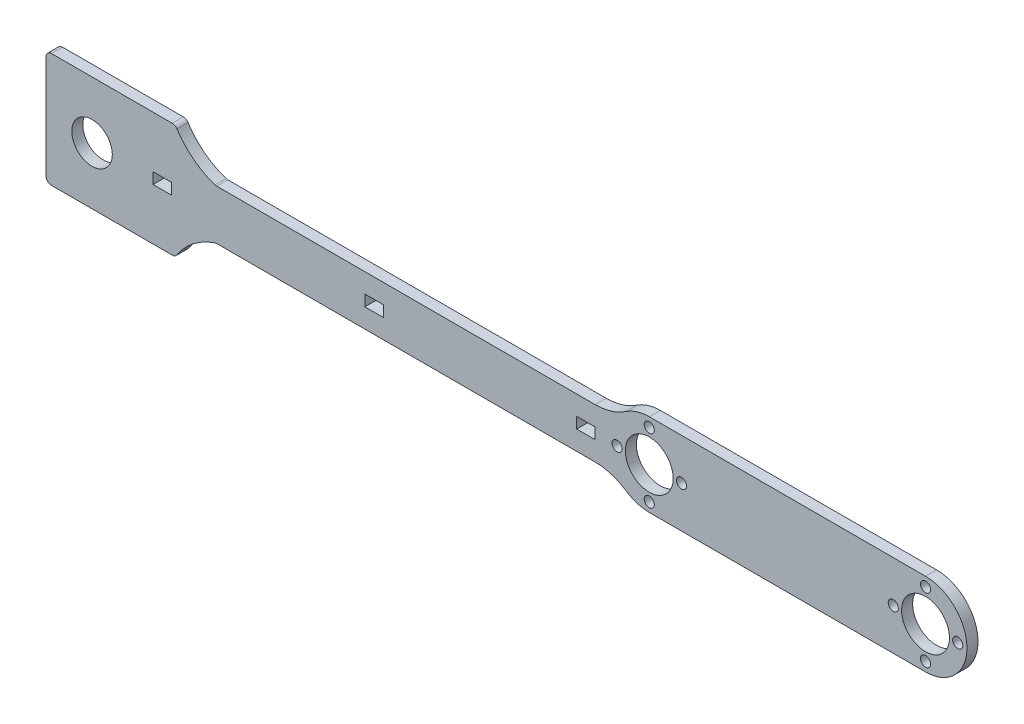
ISO-10303-21;
HEADER;
FILE_DESCRIPTION(('STEP AP214'),'2;1');
FILE_NAME('part.step','',(''),(''),'','','');
FILE_SCHEMA(('AUTOMOTIVE_DESIGN { 1 0 10303 214 1 1 1 1 }'));
ENDSEC;
DATA;
#1=APPLICATION_CONTEXT('core data for automotive mechanical design processes');
#2=APPLICATION_PROTOCOL_DEFINITION('international standard','automotive_design',2000,#1);
#3=PRODUCT_CONTEXT('',#1,'mechanical');
#4=PRODUCT('Part','Part','',(#3));
#5=PRODUCT_RELATED_PRODUCT_CATEGORY('part','',(#4));
#6=PRODUCT_DEFINITION_FORMATION('','',#4);
#7=PRODUCT_DEFINITION_CONTEXT('part definition',#1,'design');
#8=PRODUCT_DEFINITION('design','',#6,#7);
#9=PRODUCT_DEFINITION_SHAPE('','',#8);
#10=(LENGTH_UNIT() NAMED_UNIT(*) SI_UNIT(.MILLI.,.METRE.));
#11=(NAMED_UNIT(*) PLANE_ANGLE_UNIT() SI_UNIT($,.RADIAN.));
#12=(NAMED_UNIT(*) SI_UNIT($,.STERADIAN.) SOLID_ANGLE_UNIT());
#13=UNCERTAINTY_MEASURE_WITH_UNIT(LENGTH_MEASURE(1.E-05),#10,'distance_accuracy_value','');
#14=(GEOMETRIC_REPRESENTATION_CONTEXT(3) GLOBAL_UNCERTAINTY_ASSIGNED_CONTEXT((#13)) GLOBAL_UNIT_ASSIGNED_CONTEXT((#10,
#11,#12)) REPRESENTATION_CONTEXT('',''));
#15=CARTESIAN_POINT('',(0.,0.,0.));
#16=DIRECTION('',(0.,0.,1.));
#17=DIRECTION('',(1.,0.,0.));
#18=AXIS2_PLACEMENT_3D('',#15,#16,#17);
#19=CARTESIAN_POINT('',(-145.743903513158,-51.1858124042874,6.));
#20=DIRECTION('',(0.,0.,-1.));
#21=DIRECTION('',(-1.,0.,0.));
#22=AXIS2_PLACEMENT_3D('',#19,#20,#21);
#23=PLANE('',#22);
#24=CARTESIAN_POINT('',(227.527777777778,-2.66492837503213E-13,6.));
#25=DIRECTION('',(0.,0.,1.));
#26=DIRECTION('',(1.,0.,0.));
#27=AXIS2_PLACEMENT_3D('',#24,#25,#26);
#28=CIRCLE('',#27,13.);
#29=CARTESIAN_POINT('',(240.527777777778,-2.66492837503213E-13,6.));
#30=VERTEX_POINT('',#29);
#31=EDGE_CURVE('E1219',#30,#30,#28,.T.);
#32=ORIENTED_EDGE('',*,*,#31,.F.);
#33=EDGE_LOOP('',(#32));
#34=FACE_BOUND('',#33,.T.);
#35=CARTESIAN_POINT('',(227.527777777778,-17.5,6.));
#36=DIRECTION('',(0.,0.,1.));
#37=DIRECTION('',(1.,0.,0.));
#38=AXIS2_PLACEMENT_3D('',#35,#36,#37);
#39=CIRCLE('',#38,2.75000000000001);
#40=CARTESIAN_POINT('',(230.277777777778,-17.5,6.));
#41=VERTEX_POINT('',#40);
#42=EDGE_CURVE('E1225',#41,#41,#39,.T.);
#43=ORIENTED_EDGE('',*,*,#42,.F.);
#44=EDGE_LOOP('',(#43));
#45=FACE_BOUND('',#44,.T.);
#46=CARTESIAN_POINT('',(245.027777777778,0.,6.));
#47=DIRECTION('',(0.,0.,1.));
#48=DIRECTION('',(1.,0.,0.));
#49=AXIS2_PLACEMENT_3D('',#46,#47,#48);
#50=CIRCLE('',#49,2.75000000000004);
#51=CARTESIAN_POINT('',(247.777777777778,0.,6.));
#52=VERTEX_POINT('',#51);
#53=EDGE_CURVE('E1231',#52,#52,#50,.T.);
#54=ORIENTED_EDGE('',*,*,#53,.F.);
#55=EDGE_LOOP('',(#54));
#56=FACE_BOUND('',#55,.T.);
#57=CARTESIAN_POINT('',(210.027777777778,0.,6.));
#58=DIRECTION('',(0.,0.,1.));
#59=DIRECTION('',(1.,0.,0.));
#60=AXIS2_PLACEMENT_3D('',#57,#58,#59);
#61=CIRCLE('',#60,2.75000000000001);
#62=CARTESIAN_POINT('',(212.777777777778,0.,6.));
#63=VERTEX_POINT('',#62);
#64=EDGE_CURVE('E1237',#63,#63,#61,.T.);
#65=ORIENTED_EDGE('',*,*,#64,.F.);
#66=EDGE_LOOP('',(#65));
#67=FACE_BOUND('',#66,.T.);
#68=CARTESIAN_POINT('',(227.527777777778,17.5,6.));
#69=DIRECTION('',(0.,0.,1.));
#70=DIRECTION('',(1.,0.,0.));
#71=AXIS2_PLACEMENT_3D('',#68,#69,#70);
#72=CIRCLE('',#71,2.75000000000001);
#73=CARTESIAN_POINT('',(230.277777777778,17.5,6.));
#74=VERTEX_POINT('',#73);
#75=EDGE_CURVE('E1243',#74,#74,#72,.T.);
#76=ORIENTED_EDGE('',*,*,#75,.F.);
#77=EDGE_LOOP('',(#76));
#78=FACE_BOUND('',#77,.T.);
#79=CARTESIAN_POINT('',(-224.999999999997,0.,6.));
#80=DIRECTION('',(0.,0.,1.));
#81=DIRECTION('',(1.,0.,0.));
#82=AXIS2_PLACEMENT_3D('',#79,#80,#81);
#83=CIRCLE('',#82,11.);
#84=CARTESIAN_POINT('',(-213.999999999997,0.,6.));
#85=VERTEX_POINT('',#84);
#86=EDGE_CURVE('E1273',#85,#85,#83,.T.);
#87=ORIENTED_EDGE('',*,*,#86,.F.);
#88=EDGE_LOOP('',(#87));
#89=FACE_BOUND('',#88,.T.);
#90=DIRECTION('',(1.,0.,0.));
#91=VECTOR('',#90,1.);
#92=CARTESIAN_POINT('',(-250.,-31.,6.));
#93=LINE('',#92,#91);
#94=CARTESIAN_POINT('',(-247.,-31.,6.));
#95=VERTEX_POINT('',#94);
#96=CARTESIAN_POINT('',(-181.430112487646,-31.,6.));
#97=VERTEX_POINT('',#96);
#98=EDGE_CURVE('E1282',#95,#97,#93,.T.);
#99=ORIENTED_EDGE('',*,*,#98,.T.);
#100=CARTESIAN_POINT('',(-181.430112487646,-28.,6.));
#101=DIRECTION('',(0.,0.,-1.));
#102=DIRECTION('',(-1.,0.,0.));
#103=AXIS2_PLACEMENT_3D('',#100,#101,#102);
#104=CIRCLE('',#103,3.);
#105=CARTESIAN_POINT('',(-178.914452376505,-29.6344583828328,6.));
#106=VERTEX_POINT('',#105);
#107=EDGE_CURVE('E1408',#97,#106,#104,.F.);
#108=ORIENTED_EDGE('',*,*,#107,.T.);
#109=CARTESIAN_POINT('',(-145.743903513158,-51.1858124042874,6.));
#110=DIRECTION('',(0.,0.,-1.));
#111=DIRECTION('',(-1.,0.,0.));
#112=AXIS2_PLACEMENT_3D('',#109,#110,#111);
#113=CIRCLE('',#112,39.5568726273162);
#114=CARTESIAN_POINT('',(-158.236909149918,-13.6535465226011,6.));
#115=VERTEX_POINT('',#114);
#116=EDGE_CURVE('E1286',#106,#115,#113,.T.);
#117=ORIENTED_EDGE('',*,*,#116,.T.);
#118=CARTESIAN_POINT('',(-157.289437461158,-16.5000000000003,6.));
#119=DIRECTION('',(0.,0.,-1.));
#120=DIRECTION('',(-1.,0.,0.));
#121=AXIS2_PLACEMENT_3D('',#118,#119,#120);
#122=CIRCLE('',#121,3.);
#123=CARTESIAN_POINT('',(-157.289437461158,-13.5000000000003,6.));
#124=VERTEX_POINT('',#123);
#125=EDGE_CURVE('E12',#115,#124,#122,.T.);
#126=ORIENTED_EDGE('',*,*,#125,.T.);
#127=DIRECTION('',(-1.,0.,0.));
#128=VECTOR('',#127,1.);
#129=CARTESIAN_POINT('',(48.1339008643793,-13.5,6.));
#130=LINE('',#129,#128);
#131=CARTESIAN_POINT('',(48.1339008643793,-13.5,6.));
#132=VERTEX_POINT('',#131);
#133=EDGE_CURVE('E1289',#132,#124,#130,.T.);
#134=ORIENTED_EDGE('',*,*,#133,.F.);
#135=CARTESIAN_POINT('',(48.1339008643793,-43.5000000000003,6.));
#136=DIRECTION('',(0.,0.,1.));
#137=DIRECTION('',(1.,0.,0.));
#138=AXIS2_PLACEMENT_3D('',#135,#136,#137);
#139=CIRCLE('',#138,30.0000000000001);
#140=CARTESIAN_POINT('',(64.9304019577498,-18.6428571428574,6.));
#141=VERTEX_POINT('',#140);
#142=EDGE_CURVE('E1292',#141,#132,#139,.T.);
#143=ORIENTED_EDGE('',*,*,#142,.F.);
#144=CARTESIAN_POINT('',(77.5277777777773,0.,6.));
#145=DIRECTION('',(0.,0.,-1.));
#146=DIRECTION('',(-1.,0.,0.));
#147=AXIS2_PLACEMENT_3D('',#144,#145,#146);
#148=CIRCLE('',#147,22.5);
#149=CARTESIAN_POINT('',(77.5277777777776,-22.4999999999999,6.));
#150=VERTEX_POINT('',#149);
#151=EDGE_CURVE('E1295',#150,#141,#148,.T.);
#152=ORIENTED_EDGE('',*,*,#151,.F.);
#153=DIRECTION('',(1.,0.,0.));
#154=VECTOR('',#153,1.);
#155=CARTESIAN_POINT('',(77.5277777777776,-22.4999999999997,6.));
#156=LINE('',#155,#154);
#157=CARTESIAN_POINT('',(227.527777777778,-22.5,6.));
#158=VERTEX_POINT('',#157);
#159=EDGE_CURVE('E1298',#150,#158,#156,.T.);
#160=ORIENTED_EDGE('',*,*,#159,.T.);
#161=CARTESIAN_POINT('',(227.527777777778,-2.66492837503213E-13,6.));
#162=DIRECTION('',(0.,0.,1.));
#163=DIRECTION('',(1.,0.,0.));
#164=AXIS2_PLACEMENT_3D('',#161,#162,#163);
#165=CIRCLE('',#164,22.5);
#166=CARTESIAN_POINT('',(227.527777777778,22.4999999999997,6.));
#167=VERTEX_POINT('',#166);
#168=EDGE_CURVE('E1300',#158,#167,#165,.T.);
#169=ORIENTED_EDGE('',*,*,#168,.T.);
#170=DIRECTION('',(1.,0.,0.));
#171=VECTOR('',#170,1.);
#172=CARTESIAN_POINT('',(77.5277777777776,22.4999999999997,6.));
#173=LINE('',#172,#171);
#174=CARTESIAN_POINT('',(77.5277777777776,22.4999999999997,6.));
#175=VERTEX_POINT('',#174);
#176=EDGE_CURVE('E1302',#175,#167,#173,.T.);
#177=ORIENTED_EDGE('',*,*,#176,.F.);
#178=CARTESIAN_POINT('',(77.5277777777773,0.,6.));
#179=DIRECTION('',(0.,0.,-1.));
#180=DIRECTION('',(-1.,0.,0.));
#181=AXIS2_PLACEMENT_3D('',#178,#179,#180);
#182=CIRCLE('',#181,22.4999999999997);
#183=CARTESIAN_POINT('',(64.9304019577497,18.6428571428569,6.));
#184=VERTEX_POINT('',#183);
#185=EDGE_CURVE('E1305',#184,#175,#182,.T.);
#186=ORIENTED_EDGE('',*,*,#185,.F.);
#187=CARTESIAN_POINT('',(48.1339008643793,43.4999999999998,6.));
#188=DIRECTION('',(0.,0.,1.));
#189=DIRECTION('',(1.,0.,0.));
#190=AXIS2_PLACEMENT_3D('',#187,#188,#189);
#191=CIRCLE('',#190,30.);
#192=CARTESIAN_POINT('',(48.1339008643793,13.4999999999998,6.));
#193=VERTEX_POINT('',#192);
#194=EDGE_CURVE('E1308',#193,#184,#191,.T.);
#195=ORIENTED_EDGE('',*,*,#194,.F.);
#196=DIRECTION('',(-1.,0.,0.));
#197=VECTOR('',#196,1.);
#198=CARTESIAN_POINT('',(48.1339008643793,13.4999999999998,6.));
#199=LINE('',#198,#197);
#200=CARTESIAN_POINT('',(-157.289437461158,13.5000000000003,6.));
#201=VERTEX_POINT('',#200);
#202=EDGE_CURVE('E1311',#193,#201,#199,.T.);
#203=ORIENTED_EDGE('',*,*,#202,.T.);
#204=CARTESIAN_POINT('',(-157.289437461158,16.5000000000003,6.));
#205=DIRECTION('',(0.,0.,-1.));
#206=DIRECTION('',(-1.,0.,0.));
#207=AXIS2_PLACEMENT_3D('',#204,#205,#206);
#208=CIRCLE('',#207,3.);
#209=CARTESIAN_POINT('',(-158.236909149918,13.6535465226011,6.));
#210=VERTEX_POINT('',#209);
#211=EDGE_CURVE('E1421',#201,#210,#208,.T.);
#212=ORIENTED_EDGE('',*,*,#211,.T.);
#213=CARTESIAN_POINT('',(-145.743903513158,51.1858124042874,6.));
#214=DIRECTION('',(0.,0.,1.));
#215=DIRECTION('',(1.,0.,0.));
#216=AXIS2_PLACEMENT_3D('',#213,#214,#215);
#217=CIRCLE('',#216,39.5568726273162);
#218=CARTESIAN_POINT('',(-178.914452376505,29.6344583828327,6.));
#219=VERTEX_POINT('',#218);
#220=EDGE_CURVE('E1314',#219,#210,#217,.T.);
#221=ORIENTED_EDGE('',*,*,#220,.F.);
#222=CARTESIAN_POINT('',(-181.430112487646,28.,6.));
#223=DIRECTION('',(0.,0.,-1.));
#224=DIRECTION('',(-1.,0.,0.));
#225=AXIS2_PLACEMENT_3D('',#222,#223,#224);
#226=CIRCLE('',#225,3.);
#227=CARTESIAN_POINT('',(-181.430112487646,31.,6.));
#228=VERTEX_POINT('',#227);
#229=EDGE_CURVE('E915',#219,#228,#226,.F.);
#230=ORIENTED_EDGE('',*,*,#229,.T.);
#231=DIRECTION('',(1.,0.,0.));
#232=VECTOR('',#231,1.);
#233=CARTESIAN_POINT('',(-200.,31.,6.));
#234=LINE('',#233,#232);
#235=CARTESIAN_POINT('',(-247.,31.,6.));
#236=VERTEX_POINT('',#235);
#237=EDGE_CURVE('E1317',#236,#228,#234,.T.);
#238=ORIENTED_EDGE('',*,*,#237,.F.);
#239=CARTESIAN_POINT('',(-247.,28.,6.));
#240=DIRECTION('',(0.,0.,-1.));
#241=DIRECTION('',(-1.,0.,0.));
#242=AXIS2_PLACEMENT_3D('',#239,#240,#241);
#243=CIRCLE('',#242,3.);
#244=CARTESIAN_POINT('',(-250.,28.,6.));
#245=VERTEX_POINT('',#244);
#246=EDGE_CURVE('E1403',#236,#245,#243,.F.);
#247=ORIENTED_EDGE('',*,*,#246,.T.);
#248=DIRECTION('',(0.,-1.,0.));
#249=VECTOR('',#248,1.);
#250=CARTESIAN_POINT('',(-250.,21.,6.));
#251=LINE('',#250,#249);
#252=CARTESIAN_POINT('',(-250.,-28.,6.));
#253=VERTEX_POINT('',#252);
#254=EDGE_CURVE('E1279',#245,#253,#251,.T.);
#255=ORIENTED_EDGE('',*,*,#254,.T.);
#256=CARTESIAN_POINT('',(-247.,-28.,6.));
#257=DIRECTION('',(0.,0.,-1.));
#258=DIRECTION('',(-1.,0.,0.));
#259=AXIS2_PLACEMENT_3D('',#256,#257,#258);
#260=CIRCLE('',#259,3.);
#261=EDGE_CURVE('E1406',#253,#95,#260,.F.);
#262=ORIENTED_EDGE('',*,*,#261,.T.);
#263=EDGE_LOOP('',(#99,#108,#117,#126,#134,#143,#152,#160,#169,#177,#186,#195,#203,#212,#221,
#230,#238,#247,#255,#262));
#264=FACE_BOUND('',#263,.T.);
#265=CARTESIAN_POINT('',(95.0277777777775,0.,6.));
#266=DIRECTION('',(0.,0.,-1.));
#267=DIRECTION('',(-1.,0.,0.));
#268=AXIS2_PLACEMENT_3D('',#265,#266,#267);
#269=CIRCLE('',#268,2.75000000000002);
#270=CARTESIAN_POINT('',(92.2777777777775,0.,6.));
#271=VERTEX_POINT('',#270);
#272=EDGE_CURVE('E1267',#271,#271,#269,.T.);
#273=ORIENTED_EDGE('',*,*,#272,.T.);
#274=EDGE_LOOP('',(#273));
#275=FACE_BOUND('',#274,.T.);
#276=CARTESIAN_POINT('',(77.5277777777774,17.5,6.));
#277=DIRECTION('',(0.,0.,-1.));
#278=DIRECTION('',(-1.,0.,0.));
#279=AXIS2_PLACEMENT_3D('',#276,#277,#278);
#280=CIRCLE('',#279,2.75000000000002);
#281=CARTESIAN_POINT('',(74.7777777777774,17.5,6.));
#282=VERTEX_POINT('',#281);
#283=EDGE_CURVE('E1261',#282,#282,#280,.T.);
#284=ORIENTED_EDGE('',*,*,#283,.T.);
#285=EDGE_LOOP('',(#284));
#286=FACE_BOUND('',#285,.T.);
#287=CARTESIAN_POINT('',(60.0277777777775,0.,6.));
#288=DIRECTION('',(0.,0.,-1.));
#289=DIRECTION('',(-1.,0.,0.));
#290=AXIS2_PLACEMENT_3D('',#287,#288,#289);
#291=CIRCLE('',#290,2.75000000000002);
#292=CARTESIAN_POINT('',(57.2777777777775,0.,6.));
#293=VERTEX_POINT('',#292);
#294=EDGE_CURVE('E1255',#293,#293,#291,.T.);
#295=ORIENTED_EDGE('',*,*,#294,.T.);
#296=EDGE_LOOP('',(#295));
#297=FACE_BOUND('',#296,.T.);
#298=CARTESIAN_POINT('',(77.5277777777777,-17.5,6.));
#299=DIRECTION('',(0.,0.,-1.));
#300=DIRECTION('',(-1.,0.,0.));
#301=AXIS2_PLACEMENT_3D('',#298,#299,#300);
#302=CIRCLE('',#301,2.75000000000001);
#303=CARTESIAN_POINT('',(74.7777777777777,-17.5,6.));
#304=VERTEX_POINT('',#303);
#305=EDGE_CURVE('E1249',#304,#304,#302,.T.);
#306=ORIENTED_EDGE('',*,*,#305,.T.);
#307=EDGE_LOOP('',(#306));
#308=FACE_BOUND('',#307,.T.);
#309=CARTESIAN_POINT('',(77.5277777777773,0.,6.));
#310=DIRECTION('',(0.,0.,-1.));
#311=DIRECTION('',(-1.,0.,0.));
#312=AXIS2_PLACEMENT_3D('',#309,#310,#311);
#313=CIRCLE('',#312,13.0000000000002);
#314=CARTESIAN_POINT('',(64.5277777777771,0.,6.));
#315=VERTEX_POINT('',#314);
#316=EDGE_CURVE('E1213',#315,#315,#313,.T.);
#317=ORIENTED_EDGE('',*,*,#316,.T.);
#318=EDGE_LOOP('',(#317));
#319=FACE_BOUND('',#318,.T.);
#320=DIRECTION('',(0.,-1.,0.));
#321=VECTOR('',#320,1.);
#322=CARTESIAN_POINT('',(-191.866099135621,3.,6.));
#323=LINE('',#322,#321);
#324=CARTESIAN_POINT('',(-191.866099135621,3.,6.));
#325=VERTEX_POINT('',#324);
#326=CARTESIAN_POINT('',(-191.866099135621,-3.,6.));
#327=VERTEX_POINT('',#326);
#328=EDGE_CURVE('E1192',#325,#327,#323,.T.);
#329=ORIENTED_EDGE('',*,*,#328,.F.);
#330=DIRECTION('',(1.,0.,0.));
#331=VECTOR('',#330,1.);
#332=CARTESIAN_POINT('',(-191.866099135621,3.,6.));
#333=LINE('',#332,#331);
#334=CARTESIAN_POINT('',(-181.866099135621,2.99999999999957,6.));
#335=VERTEX_POINT('',#334);
#336=EDGE_CURVE('E1182',#325,#335,#333,.T.);
#337=ORIENTED_EDGE('',*,*,#336,.T.);
#338=DIRECTION('',(0.,-1.,0.));
#339=VECTOR('',#338,1.);
#340=CARTESIAN_POINT('',(-181.866099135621,2.99999999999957,6.));
#341=LINE('',#340,#339);
#342=CARTESIAN_POINT('',(-181.866099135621,-2.99999999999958,6.));
#343=VERTEX_POINT('',#342);
#344=EDGE_CURVE('E1185',#335,#343,#341,.T.);
#345=ORIENTED_EDGE('',*,*,#344,.T.);
#346=DIRECTION('',(1.,0.,0.));
#347=VECTOR('',#346,1.);
#348=CARTESIAN_POINT('',(-191.866099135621,-3.,6.));
#349=LINE('',#348,#347);
#350=EDGE_CURVE('E1189',#327,#343,#349,.T.);
#351=ORIENTED_EDGE('',*,*,#350,.F.);
#352=EDGE_LOOP('',(#329,#337,#345,#351));
#353=FACE_BOUND('',#352,.T.);
#354=DIRECTION('',(0.,-1.,0.));
#355=VECTOR('',#354,1.);
#356=CARTESIAN_POINT('',(-76.8660991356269,3.,6.));
#357=LINE('',#356,#355);
#358=CARTESIAN_POINT('',(-76.8660991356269,3.,6.));
#359=VERTEX_POINT('',#358);
#360=CARTESIAN_POINT('',(-76.8660991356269,-3.,6.));
#361=VERTEX_POINT('',#360);
#362=EDGE_CURVE('E1161',#359,#361,#357,.T.);
#363=ORIENTED_EDGE('',*,*,#362,.F.);
#364=DIRECTION('',(1.,0.,0.));
#365=VECTOR('',#364,1.);
#366=CARTESIAN_POINT('',(-76.8660991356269,3.,6.));
#367=LINE('',#366,#365);
#368=CARTESIAN_POINT('',(-66.8660991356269,3.,6.));
#369=VERTEX_POINT('',#368);
#370=EDGE_CURVE('E1151',#359,#369,#367,.T.);
#371=ORIENTED_EDGE('',*,*,#370,.T.);
#372=DIRECTION('',(0.,-1.,0.));
#373=VECTOR('',#372,1.);
#374=CARTESIAN_POINT('',(-66.8660991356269,3.,6.));
#375=LINE('',#374,#373);
#376=CARTESIAN_POINT('',(-66.8660991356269,-3.,6.));
#377=VERTEX_POINT('',#376);
#378=EDGE_CURVE('E1154',#369,#377,#375,.T.);
#379=ORIENTED_EDGE('',*,*,#378,.T.);
#380=DIRECTION('',(1.,0.,0.));
#381=VECTOR('',#380,1.);
#382=CARTESIAN_POINT('',(-76.8660991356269,-3.,6.));
#383=LINE('',#382,#381);
#384=EDGE_CURVE('E1158',#361,#377,#383,.T.);
#385=ORIENTED_EDGE('',*,*,#384,.F.);
#386=EDGE_LOOP('',(#363,#371,#379,#385));
#387=FACE_BOUND('',#386,.T.);
#388=DIRECTION('',(-1.,0.,0.));
#389=VECTOR('',#388,1.);
#390=CARTESIAN_POINT('',(48.1339008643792,3.00000000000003,6.));
#391=LINE('',#390,#389);
#392=CARTESIAN_POINT('',(48.1339008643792,3.00000000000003,6.));
#393=VERTEX_POINT('',#392);
#394=CARTESIAN_POINT('',(38.1339008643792,3.00000000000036,6.));
#395=VERTEX_POINT('',#394);
#396=EDGE_CURVE('E1110',#393,#395,#391,.T.);
#397=ORIENTED_EDGE('',*,*,#396,.F.);
#398=DIRECTION('',(0.,-1.,0.));
#399=VECTOR('',#398,1.);
#400=CARTESIAN_POINT('',(48.1339008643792,3.00000000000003,6.));
#401=LINE('',#400,#399);
#402=CARTESIAN_POINT('',(48.1339008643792,-3.00000000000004,6.));
#403=VERTEX_POINT('',#402);
#404=EDGE_CURVE('E1135',#393,#403,#401,.T.);
#405=ORIENTED_EDGE('',*,*,#404,.T.);
#406=DIRECTION('',(-1.,1.24900090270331E-13,0.));
#407=VECTOR('',#406,1.);
#408=CARTESIAN_POINT('',(48.1339008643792,-3.00000000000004,6.));
#409=LINE('',#408,#407);
#410=CARTESIAN_POINT('',(38.1339008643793,-2.99999999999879,6.));
#411=VERTEX_POINT('',#410);
#412=EDGE_CURVE('E1133',#403,#411,#409,.T.);
#413=ORIENTED_EDGE('',*,*,#412,.T.);
#414=DIRECTION('',(0.,-1.,0.));
#415=VECTOR('',#414,1.);
#416=CARTESIAN_POINT('',(38.1339008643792,3.00000000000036,6.));
#417=LINE('',#416,#415);
#418=EDGE_CURVE('E1121',#395,#411,#417,.T.);
#419=ORIENTED_EDGE('',*,*,#418,.F.);
#420=EDGE_LOOP('',(#397,#405,#413,#419));
#421=FACE_BOUND('',#420,.T.);
#422=ADVANCED_FACE('F900',(#34,#45,#56,#67,#78,#89,#264,#275,#286,#297,#308,#319,#353,#387,
#421),#23,.F.);
#423=CARTESIAN_POINT('',(-145.743903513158,-51.1858124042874,0.));
#424=DIRECTION('',(0.,0.,-1.));
#425=DIRECTION('',(-1.,0.,0.));
#426=AXIS2_PLACEMENT_3D('',#423,#424,#425);
#427=PLANE('',#426);
#428=DIRECTION('',(1.,0.,0.));
#429=VECTOR('',#428,1.);
#430=CARTESIAN_POINT('',(-76.8660991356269,3.,0.));
#431=LINE('',#430,#429);
#432=CARTESIAN_POINT('',(-76.8660991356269,3.,0.));
#433=VERTEX_POINT('',#432);
#434=CARTESIAN_POINT('',(-66.8660991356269,3.,0.));
#435=VERTEX_POINT('',#434);
#436=EDGE_CURVE('E1129',#433,#435,#431,.T.);
#437=ORIENTED_EDGE('',*,*,#436,.F.);
#438=DIRECTION('',(0.,-1.,0.));
#439=VECTOR('',#438,1.);
#440=CARTESIAN_POINT('',(-76.8660991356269,3.,0.));
#441=LINE('',#440,#439);
#442=CARTESIAN_POINT('',(-76.8660991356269,-3.,0.));
#443=VERTEX_POINT('',#442);
#444=EDGE_CURVE('E1155',#433,#443,#441,.T.);
#445=ORIENTED_EDGE('',*,*,#444,.T.);
#446=DIRECTION('',(1.,0.,0.));
#447=VECTOR('',#446,1.);
#448=CARTESIAN_POINT('',(-76.8660991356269,-3.,0.));
#449=LINE('',#448,#447);
#450=CARTESIAN_POINT('',(-66.8660991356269,-3.,0.));
#451=VERTEX_POINT('',#450);
#452=EDGE_CURVE('E1168',#443,#451,#449,.T.);
#453=ORIENTED_EDGE('',*,*,#452,.T.);
#454=DIRECTION('',(0.,-1.,0.));
#455=VECTOR('',#454,1.);
#456=CARTESIAN_POINT('',(-66.8660991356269,3.,0.));
#457=LINE('',#456,#455);
#458=EDGE_CURVE('E1165',#435,#451,#457,.T.);
#459=ORIENTED_EDGE('',*,*,#458,.F.);
#460=EDGE_LOOP('',(#437,#445,#453,#459));
#461=FACE_BOUND('',#460,.T.);
#462=DIRECTION('',(1.,0.,0.));
#463=VECTOR('',#462,1.);
#464=CARTESIAN_POINT('',(-191.866099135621,3.,0.));
#465=LINE('',#464,#463);
#466=CARTESIAN_POINT('',(-191.866099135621,3.,0.));
#467=VERTEX_POINT('',#466);
#468=CARTESIAN_POINT('',(-181.866099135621,2.99999999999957,0.));
#469=VERTEX_POINT('',#468);
#470=EDGE_CURVE('E1175',#467,#469,#465,.T.);
#471=ORIENTED_EDGE('',*,*,#470,.F.);
#472=DIRECTION('',(0.,-1.,0.));
#473=VECTOR('',#472,1.);
#474=CARTESIAN_POINT('',(-191.866099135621,3.,0.));
#475=LINE('',#474,#473);
#476=CARTESIAN_POINT('',(-191.866099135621,-3.,0.));
#477=VERTEX_POINT('',#476);
#478=EDGE_CURVE('E1186',#467,#477,#475,.T.);
#479=ORIENTED_EDGE('',*,*,#478,.T.);
#480=DIRECTION('',(1.,0.,0.));
#481=VECTOR('',#480,1.);
#482=CARTESIAN_POINT('',(-191.866099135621,-3.,0.));
#483=LINE('',#482,#481);
#484=CARTESIAN_POINT('',(-181.866099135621,-2.99999999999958,0.));
#485=VERTEX_POINT('',#484);
#486=EDGE_CURVE('E1199',#477,#485,#483,.T.);
#487=ORIENTED_EDGE('',*,*,#486,.T.);
#488=DIRECTION('',(0.,-1.,0.));
#489=VECTOR('',#488,1.);
#490=CARTESIAN_POINT('',(-181.866099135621,2.99999999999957,0.));
#491=LINE('',#490,#489);
#492=EDGE_CURVE('E1196',#469,#485,#491,.T.);
#493=ORIENTED_EDGE('',*,*,#492,.F.);
#494=EDGE_LOOP('',(#471,#479,#487,#493));
#495=FACE_BOUND('',#494,.T.);
#496=CARTESIAN_POINT('',(77.5277777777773,0.,0.));
#497=DIRECTION('',(0.,0.,-1.));
#498=DIRECTION('',(-1.,0.,0.));
#499=AXIS2_PLACEMENT_3D('',#496,#497,#498);
#500=CIRCLE('',#499,13.0000000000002);
#501=CARTESIAN_POINT('',(64.5277777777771,0.,0.));
#502=VERTEX_POINT('',#501);
#503=EDGE_CURVE('E1206',#502,#502,#500,.T.);
#504=ORIENTED_EDGE('',*,*,#503,.F.);
#505=EDGE_LOOP('',(#504));
#506=FACE_BOUND('',#505,.T.);
#507=CARTESIAN_POINT('',(227.527777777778,-17.5,0.));
#508=DIRECTION('',(0.,0.,1.));
#509=DIRECTION('',(1.,0.,0.));
#510=AXIS2_PLACEMENT_3D('',#507,#508,#509);
#511=CIRCLE('',#510,2.75000000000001);
#512=CARTESIAN_POINT('',(230.277777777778,-17.5,0.));
#513=VERTEX_POINT('',#512);
#514=EDGE_CURVE('E1222',#513,#513,#511,.T.);
#515=ORIENTED_EDGE('',*,*,#514,.T.);
#516=EDGE_LOOP('',(#515));
#517=FACE_BOUND('',#516,.T.);
#518=CARTESIAN_POINT('',(210.027777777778,0.,0.));
#519=DIRECTION('',(0.,0.,1.));
#520=DIRECTION('',(1.,0.,0.));
#521=AXIS2_PLACEMENT_3D('',#518,#519,#520);
#522=CIRCLE('',#521,2.75000000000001);
#523=CARTESIAN_POINT('',(212.777777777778,0.,0.));
#524=VERTEX_POINT('',#523);
#525=EDGE_CURVE('E1234',#524,#524,#522,.T.);
#526=ORIENTED_EDGE('',*,*,#525,.T.);
#527=EDGE_LOOP('',(#526));
#528=FACE_BOUND('',#527,.T.);
#529=CARTESIAN_POINT('',(-224.999999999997,0.,0.));
#530=DIRECTION('',(0.,0.,1.));
#531=DIRECTION('',(1.,0.,0.));
#532=AXIS2_PLACEMENT_3D('',#529,#530,#531);
#533=CIRCLE('',#532,11.);
#534=CARTESIAN_POINT('',(-213.999999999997,0.,0.));
#535=VERTEX_POINT('',#534);
#536=EDGE_CURVE('E1270',#535,#535,#533,.T.);
#537=ORIENTED_EDGE('',*,*,#536,.T.);
#538=EDGE_LOOP('',(#537));
#539=FACE_BOUND('',#538,.T.);
#540=CARTESIAN_POINT('',(-145.743903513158,-51.1858124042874,0.));
#541=DIRECTION('',(0.,0.,-1.));
#542=DIRECTION('',(-1.,0.,0.));
#543=AXIS2_PLACEMENT_3D('',#540,#541,#542);
#544=CIRCLE('',#543,39.5568726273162);
#545=CARTESIAN_POINT('',(-178.914452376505,-29.6344583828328,0.));
#546=VERTEX_POINT('',#545);
#547=CARTESIAN_POINT('',(-158.236909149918,-13.6535465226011,0.));
#548=VERTEX_POINT('',#547);
#549=EDGE_CURVE('E1322',#546,#548,#544,.T.);
#550=ORIENTED_EDGE('',*,*,#549,.F.);
#551=CARTESIAN_POINT('',(-181.430112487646,-28.,0.));
#552=DIRECTION('',(0.,0.,-1.));
#553=DIRECTION('',(-1.,0.,0.));
#554=AXIS2_PLACEMENT_3D('',#551,#552,#553);
#555=CIRCLE('',#554,3.);
#556=CARTESIAN_POINT('',(-181.430112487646,-31.,0.));
#557=VERTEX_POINT('',#556);
#558=EDGE_CURVE('E1396',#546,#557,#555,.T.);
#559=ORIENTED_EDGE('',*,*,#558,.T.);
#560=DIRECTION('',(1.,0.,0.));
#561=VECTOR('',#560,1.);
#562=CARTESIAN_POINT('',(-200.,-31.,0.));
#563=LINE('',#562,#561);
#564=CARTESIAN_POINT('',(-247.,-31.,0.));
#565=VERTEX_POINT('',#564);
#566=EDGE_CURVE('E1276',#565,#557,#563,.T.);
#567=ORIENTED_EDGE('',*,*,#566,.F.);
#568=CARTESIAN_POINT('',(-247.,-28.,0.));
#569=DIRECTION('',(0.,0.,-1.));
#570=DIRECTION('',(-1.,0.,0.));
#571=AXIS2_PLACEMENT_3D('',#568,#569,#570);
#572=CIRCLE('',#571,3.);
#573=CARTESIAN_POINT('',(-250.,-28.,0.));
#574=VERTEX_POINT('',#573);
#575=EDGE_CURVE('E1394',#565,#574,#572,.T.);
#576=ORIENTED_EDGE('',*,*,#575,.T.);
#577=DIRECTION('',(0.,-1.,0.));
#578=VECTOR('',#577,1.);
#579=CARTESIAN_POINT('',(-250.,22.5,0.));
#580=LINE('',#579,#578);
#581=CARTESIAN_POINT('',(-250.,28.,0.));
#582=VERTEX_POINT('',#581);
#583=EDGE_CURVE('E1283',#582,#574,#580,.T.);
#584=ORIENTED_EDGE('',*,*,#583,.F.);
#585=CARTESIAN_POINT('',(-247.,28.,0.));
#586=DIRECTION('',(0.,0.,-1.));
#587=DIRECTION('',(-1.,0.,0.));
#588=AXIS2_PLACEMENT_3D('',#585,#586,#587);
#589=CIRCLE('',#588,3.);
#590=CARTESIAN_POINT('',(-247.,31.,0.));
#591=VERTEX_POINT('',#590);
#592=EDGE_CURVE('E1390',#582,#591,#589,.T.);
#593=ORIENTED_EDGE('',*,*,#592,.T.);
#594=DIRECTION('',(1.,0.,0.));
#595=VECTOR('',#594,1.);
#596=CARTESIAN_POINT('',(-250.,31.,0.));
#597=LINE('',#596,#595);
#598=CARTESIAN_POINT('',(-181.430112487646,31.,0.));
#599=VERTEX_POINT('',#598);
#600=EDGE_CURVE('E1354',#591,#599,#597,.T.);
#601=ORIENTED_EDGE('',*,*,#600,.T.);
#602=CARTESIAN_POINT('',(-181.430112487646,28.,0.));
#603=DIRECTION('',(0.,0.,-1.));
#604=DIRECTION('',(-1.,0.,0.));
#605=AXIS2_PLACEMENT_3D('',#602,#603,#604);
#606=CIRCLE('',#605,3.);
#607=CARTESIAN_POINT('',(-178.914452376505,29.6344583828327,0.));
#608=VERTEX_POINT('',#607);
#609=EDGE_CURVE('E1392',#599,#608,#606,.T.);
#610=ORIENTED_EDGE('',*,*,#609,.T.);
#611=CARTESIAN_POINT('',(-145.743903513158,51.1858124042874,0.));
#612=DIRECTION('',(0.,0.,1.));
#613=DIRECTION('',(1.,0.,0.));
#614=AXIS2_PLACEMENT_3D('',#611,#612,#613);
#615=CIRCLE('',#614,39.5568726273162);
#616=CARTESIAN_POINT('',(-158.236909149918,13.6535465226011,0.));
#617=VERTEX_POINT('',#616);
#618=EDGE_CURVE('E1351',#608,#617,#615,.T.);
#619=ORIENTED_EDGE('',*,*,#618,.T.);
#620=CARTESIAN_POINT('',(-157.289437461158,16.5000000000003,0.));
#621=DIRECTION('',(0.,0.,-1.));
#622=DIRECTION('',(-1.,0.,0.));
#623=AXIS2_PLACEMENT_3D('',#620,#621,#622);
#624=CIRCLE('',#623,3.);
#625=CARTESIAN_POINT('',(-157.289437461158,13.5000000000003,0.));
#626=VERTEX_POINT('',#625);
#627=EDGE_CURVE('E1419',#617,#626,#624,.F.);
#628=ORIENTED_EDGE('',*,*,#627,.T.);
#629=DIRECTION('',(-1.,0.,0.));
#630=VECTOR('',#629,1.);
#631=CARTESIAN_POINT('',(48.1339008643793,13.4999999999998,0.));
#632=LINE('',#631,#630);
#633=CARTESIAN_POINT('',(48.1339008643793,13.4999999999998,0.));
#634=VERTEX_POINT('',#633);
#635=EDGE_CURVE('E1348',#634,#626,#632,.T.);
#636=ORIENTED_EDGE('',*,*,#635,.F.);
#637=CARTESIAN_POINT('',(48.1339008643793,43.4999999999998,0.));
#638=DIRECTION('',(0.,0.,1.));
#639=DIRECTION('',(1.,0.,0.));
#640=AXIS2_PLACEMENT_3D('',#637,#638,#639);
#641=CIRCLE('',#640,30.);
#642=CARTESIAN_POINT('',(64.9304019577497,18.6428571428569,0.));
#643=VERTEX_POINT('',#642);
#644=EDGE_CURVE('E1345',#634,#643,#641,.T.);
#645=ORIENTED_EDGE('',*,*,#644,.T.);
#646=CARTESIAN_POINT('',(77.5277777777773,0.,0.));
#647=DIRECTION('',(0.,0.,-1.));
#648=DIRECTION('',(-1.,0.,0.));
#649=AXIS2_PLACEMENT_3D('',#646,#647,#648);
#650=CIRCLE('',#649,22.4999999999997);
#651=CARTESIAN_POINT('',(77.5277777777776,22.4999999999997,0.));
#652=VERTEX_POINT('',#651);
#653=EDGE_CURVE('E1342',#643,#652,#650,.T.);
#654=ORIENTED_EDGE('',*,*,#653,.T.);
#655=DIRECTION('',(1.,0.,0.));
#656=VECTOR('',#655,1.);
#657=CARTESIAN_POINT('',(77.5277777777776,22.4999999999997,0.));
#658=LINE('',#657,#656);
#659=CARTESIAN_POINT('',(227.527777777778,22.4999999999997,0.));
#660=VERTEX_POINT('',#659);
#661=EDGE_CURVE('E1339',#652,#660,#658,.T.);
#662=ORIENTED_EDGE('',*,*,#661,.T.);
#663=CARTESIAN_POINT('',(227.527777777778,-2.66492837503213E-13,0.));
#664=DIRECTION('',(0.,0.,1.));
#665=DIRECTION('',(1.,0.,0.));
#666=AXIS2_PLACEMENT_3D('',#663,#664,#665);
#667=CIRCLE('',#666,22.5);
#668=CARTESIAN_POINT('',(227.527777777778,-22.5,0.));
#669=VERTEX_POINT('',#668);
#670=EDGE_CURVE('E1336',#669,#660,#667,.T.);
#671=ORIENTED_EDGE('',*,*,#670,.F.);
#672=DIRECTION('',(1.,0.,0.));
#673=VECTOR('',#672,1.);
#674=CARTESIAN_POINT('',(77.5277777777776,-22.4999999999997,0.));
#675=LINE('',#674,#673);
#676=CARTESIAN_POINT('',(77.5277777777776,-22.4999999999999,0.));
#677=VERTEX_POINT('',#676);
#678=EDGE_CURVE('E1334',#677,#669,#675,.T.);
#679=ORIENTED_EDGE('',*,*,#678,.F.);
#680=CARTESIAN_POINT('',(77.5277777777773,0.,0.));
#681=DIRECTION('',(0.,0.,-1.));
#682=DIRECTION('',(-1.,0.,0.));
#683=AXIS2_PLACEMENT_3D('',#680,#681,#682);
#684=CIRCLE('',#683,22.5);
#685=CARTESIAN_POINT('',(64.9304019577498,-18.6428571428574,0.));
#686=VERTEX_POINT('',#685);
#687=EDGE_CURVE('E1331',#677,#686,#684,.T.);
#688=ORIENTED_EDGE('',*,*,#687,.T.);
#689=CARTESIAN_POINT('',(48.1339008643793,-43.5000000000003,0.));
#690=DIRECTION('',(0.,0.,1.));
#691=DIRECTION('',(1.,0.,0.));
#692=AXIS2_PLACEMENT_3D('',#689,#690,#691);
#693=CIRCLE('',#692,30.0000000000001);
#694=CARTESIAN_POINT('',(48.1339008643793,-13.5,0.));
#695=VERTEX_POINT('',#694);
#696=EDGE_CURVE('E1328',#686,#695,#693,.T.);
#697=ORIENTED_EDGE('',*,*,#696,.T.);
#698=DIRECTION('',(-1.,0.,0.));
#699=VECTOR('',#698,1.);
#700=CARTESIAN_POINT('',(48.1339008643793,-13.5,0.));
#701=LINE('',#700,#699);
#702=CARTESIAN_POINT('',(-157.289437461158,-13.5000000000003,0.));
#703=VERTEX_POINT('',#702);
#704=EDGE_CURVE('E1325',#695,#703,#701,.T.);
#705=ORIENTED_EDGE('',*,*,#704,.T.);
#706=CARTESIAN_POINT('',(-157.289437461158,-16.5000000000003,0.));
#707=DIRECTION('',(0.,0.,-1.));
#708=DIRECTION('',(-1.,0.,0.));
#709=AXIS2_PLACEMENT_3D('',#706,#707,#708);
#710=CIRCLE('',#709,3.);
#711=EDGE_CURVE('E908',#703,#548,#710,.F.);
#712=ORIENTED_EDGE('',*,*,#711,.T.);
#713=EDGE_LOOP('',(#550,#559,#567,#576,#584,#593,#601,#610,#619,#628,#636,#645,#654,#662,#671,
#679,#688,#697,#705,#712));
#714=FACE_BOUND('',#713,.T.);
#715=CARTESIAN_POINT('',(95.0277777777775,0.,0.));
#716=DIRECTION('',(0.,0.,-1.));
#717=DIRECTION('',(-1.,0.,0.));
#718=AXIS2_PLACEMENT_3D('',#715,#716,#717);
#719=CIRCLE('',#718,2.75000000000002);
#720=CARTESIAN_POINT('',(92.2777777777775,0.,0.));
#721=VERTEX_POINT('',#720);
#722=EDGE_CURVE('E1264',#721,#721,#719,.T.);
#723=ORIENTED_EDGE('',*,*,#722,.F.);
#724=EDGE_LOOP('',(#723));
#725=FACE_BOUND('',#724,.T.);
#726=CARTESIAN_POINT('',(77.5277777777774,17.5,0.));
#727=DIRECTION('',(0.,0.,-1.));
#728=DIRECTION('',(-1.,0.,0.));
#729=AXIS2_PLACEMENT_3D('',#726,#727,#728);
#730=CIRCLE('',#729,2.75000000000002);
#731=CARTESIAN_POINT('',(74.7777777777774,17.5,0.));
#732=VERTEX_POINT('',#731);
#733=EDGE_CURVE('E1258',#732,#732,#730,.T.);
#734=ORIENTED_EDGE('',*,*,#733,.F.);
#735=EDGE_LOOP('',(#734));
#736=FACE_BOUND('',#735,.T.);
#737=CARTESIAN_POINT('',(60.0277777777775,0.,0.));
#738=DIRECTION('',(0.,0.,-1.));
#739=DIRECTION('',(-1.,0.,0.));
#740=AXIS2_PLACEMENT_3D('',#737,#738,#739);
#741=CIRCLE('',#740,2.75000000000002);
#742=CARTESIAN_POINT('',(57.2777777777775,0.,0.));
#743=VERTEX_POINT('',#742);
#744=EDGE_CURVE('E1252',#743,#743,#741,.T.);
#745=ORIENTED_EDGE('',*,*,#744,.F.);
#746=EDGE_LOOP('',(#745));
#747=FACE_BOUND('',#746,.T.);
#748=CARTESIAN_POINT('',(77.5277777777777,-17.5,0.));
#749=DIRECTION('',(0.,0.,-1.));
#750=DIRECTION('',(-1.,0.,0.));
#751=AXIS2_PLACEMENT_3D('',#748,#749,#750);
#752=CIRCLE('',#751,2.75000000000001);
#753=CARTESIAN_POINT('',(74.7777777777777,-17.5,0.));
#754=VERTEX_POINT('',#753);
#755=EDGE_CURVE('E1246',#754,#754,#752,.T.);
#756=ORIENTED_EDGE('',*,*,#755,.F.);
#757=EDGE_LOOP('',(#756));
#758=FACE_BOUND('',#757,.T.);
#759=CARTESIAN_POINT('',(227.527777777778,17.5,0.));
#760=DIRECTION('',(0.,0.,1.));
#761=DIRECTION('',(1.,0.,0.));
#762=AXIS2_PLACEMENT_3D('',#759,#760,#761);
#763=CIRCLE('',#762,2.75000000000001);
#764=CARTESIAN_POINT('',(230.277777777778,17.5,0.));
#765=VERTEX_POINT('',#764);
#766=EDGE_CURVE('E1240',#765,#765,#763,.T.);
#767=ORIENTED_EDGE('',*,*,#766,.T.);
#768=EDGE_LOOP('',(#767));
#769=FACE_BOUND('',#768,.T.);
#770=CARTESIAN_POINT('',(245.027777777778,0.,0.));
#771=DIRECTION('',(0.,0.,1.));
#772=DIRECTION('',(1.,0.,0.));
#773=AXIS2_PLACEMENT_3D('',#770,#771,#772);
#774=CIRCLE('',#773,2.75000000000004);
#775=CARTESIAN_POINT('',(247.777777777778,0.,0.));
#776=VERTEX_POINT('',#775);
#777=EDGE_CURVE('E1228',#776,#776,#774,.T.);
#778=ORIENTED_EDGE('',*,*,#777,.T.);
#779=EDGE_LOOP('',(#778));
#780=FACE_BOUND('',#779,.T.);
#781=CARTESIAN_POINT('',(227.527777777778,-2.66492837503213E-13,0.));
#782=DIRECTION('',(0.,0.,1.));
#783=DIRECTION('',(1.,0.,0.));
#784=AXIS2_PLACEMENT_3D('',#781,#782,#783);
#785=CIRCLE('',#784,13.);
#786=CARTESIAN_POINT('',(240.527777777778,-2.66492837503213E-13,0.));
#787=VERTEX_POINT('',#786);
#788=EDGE_CURVE('E1216',#787,#787,#785,.T.);
#789=ORIENTED_EDGE('',*,*,#788,.T.);
#790=EDGE_LOOP('',(#789));
#791=FACE_BOUND('',#790,.T.);
#792=DIRECTION('',(0.,-1.,0.));
#793=VECTOR('',#792,1.);
#794=CARTESIAN_POINT('',(48.1339008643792,3.00000000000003,0.));
#795=LINE('',#794,#793);
#796=CARTESIAN_POINT('',(48.1339008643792,3.00000000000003,0.));
#797=VERTEX_POINT('',#796);
#798=CARTESIAN_POINT('',(48.1339008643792,-3.00000000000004,0.));
#799=VERTEX_POINT('',#798);
#800=EDGE_CURVE('E1122',#797,#799,#795,.T.);
#801=ORIENTED_EDGE('',*,*,#800,.F.);
#802=DIRECTION('',(-1.,0.,0.));
#803=VECTOR('',#802,1.);
#804=CARTESIAN_POINT('',(48.1339008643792,3.00000000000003,0.));
#805=LINE('',#804,#803);
#806=CARTESIAN_POINT('',(38.1339008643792,3.00000000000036,0.));
#807=VERTEX_POINT('',#806);
#808=EDGE_CURVE('E1139',#797,#807,#805,.T.);
#809=ORIENTED_EDGE('',*,*,#808,.T.);
#810=DIRECTION('',(0.,-1.,0.));
#811=VECTOR('',#810,1.);
#812=CARTESIAN_POINT('',(38.1339008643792,3.00000000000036,0.));
#813=LINE('',#812,#811);
#814=CARTESIAN_POINT('',(38.1339008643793,-2.99999999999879,0.));
#815=VERTEX_POINT('',#814);
#816=EDGE_CURVE('E1128',#807,#815,#813,.T.);
#817=ORIENTED_EDGE('',*,*,#816,.T.);
#818=DIRECTION('',(-1.,1.24900090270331E-13,0.));
#819=VECTOR('',#818,1.);
#820=CARTESIAN_POINT('',(48.1339008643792,-3.00000000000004,0.));
#821=LINE('',#820,#819);
#822=EDGE_CURVE('E1142',#799,#815,#821,.T.);
#823=ORIENTED_EDGE('',*,*,#822,.F.);
#824=EDGE_LOOP('',(#801,#809,#817,#823));
#825=FACE_BOUND('',#824,.T.);
#826=ADVANCED_FACE('F1424',(#461,#495,#506,#517,#528,#539,#714,#725,#736,#747,#758,#769,#780,
#791,#825),#427,.T.);
#827=CARTESIAN_POINT('',(-200.,-31.,6.));
#828=DIRECTION('',(0.,1.,0.));
#829=DIRECTION('',(0.,0.,1.));
#830=AXIS2_PLACEMENT_3D('',#827,#828,#829);
#831=PLANE('',#830);
#832=ORIENTED_EDGE('',*,*,#566,.T.);
#833=DIRECTION('',(0.,0.,-1.));
#834=VECTOR('',#833,1.);
#835=CARTESIAN_POINT('',(-181.430112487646,-31.,6.));
#836=LINE('',#835,#834);
#837=EDGE_CURVE('E1401',#557,#97,#836,.F.);
#838=ORIENTED_EDGE('',*,*,#837,.T.);
#839=ORIENTED_EDGE('',*,*,#98,.F.);
#840=DIRECTION('',(0.,0.,-1.));
#841=VECTOR('',#840,1.);
#842=CARTESIAN_POINT('',(-247.,-31.,6.));
#843=LINE('',#842,#841);
#844=EDGE_CURVE('E1398',#95,#565,#843,.T.);
#845=ORIENTED_EDGE('',*,*,#844,.T.);
#846=EDGE_LOOP('',(#832,#838,#839,#845));
#847=FACE_BOUND('',#846,.T.);
#848=ADVANCED_FACE('F1502',(#847),#831,.F.);
#849=CARTESIAN_POINT('',(-145.743903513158,-51.1858124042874,6.));
#850=DIRECTION('',(0.,0.,-1.));
#851=DIRECTION('',(-1.,0.,0.));
#852=AXIS2_PLACEMENT_3D('',#849,#850,#851);
#853=CYLINDRICAL_SURFACE('',#852,39.5568726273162);
#854=ORIENTED_EDGE('',*,*,#549,.T.);
#855=DIRECTION('',(0.,0.,-1.));
#856=VECTOR('',#855,1.);
#857=CARTESIAN_POINT('',(-158.236909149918,-13.6535465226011,6.));
#858=LINE('',#857,#856);
#859=EDGE_CURVE('E1388',#548,#115,#858,.F.);
#860=ORIENTED_EDGE('',*,*,#859,.T.);
#861=ORIENTED_EDGE('',*,*,#116,.F.);
#862=DIRECTION('',(0.,0.,-1.));
#863=VECTOR('',#862,1.);
#864=CARTESIAN_POINT('',(-178.914452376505,-29.6344583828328,6.));
#865=LINE('',#864,#863);
#866=EDGE_CURVE('E1385',#106,#546,#865,.T.);
#867=ORIENTED_EDGE('',*,*,#866,.T.);
#868=EDGE_LOOP('',(#854,#860,#861,#867));
#869=FACE_BOUND('',#868,.T.);
#870=ADVANCED_FACE('F1431',(#869),#853,.F.);
#871=CARTESIAN_POINT('',(48.1339008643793,-13.5,6.));
#872=DIRECTION('',(0.,-1.,0.));
#873=DIRECTION('',(1.,0.,0.));
#874=AXIS2_PLACEMENT_3D('',#871,#872,#873);
#875=PLANE('',#874);
#876=ORIENTED_EDGE('',*,*,#133,.T.);
#877=DIRECTION('',(0.,0.,-1.));
#878=VECTOR('',#877,1.);
#879=CARTESIAN_POINT('',(-157.289437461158,-13.5000000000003,6.));
#880=LINE('',#879,#878);
#881=EDGE_CURVE('E1382',#124,#703,#880,.T.);
#882=ORIENTED_EDGE('',*,*,#881,.T.);
#883=ORIENTED_EDGE('',*,*,#704,.F.);
#884=DIRECTION('',(0.,0.,-1.));
#885=VECTOR('',#884,1.);
#886=CARTESIAN_POINT('',(48.1339008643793,-13.5,6.));
#887=LINE('',#886,#885);
#888=EDGE_CURVE('E1373',#132,#695,#887,.T.);
#889=ORIENTED_EDGE('',*,*,#888,.F.);
#890=EDGE_LOOP('',(#876,#882,#883,#889));
#891=FACE_BOUND('',#890,.T.);
#892=ADVANCED_FACE('F1440',(#891),#875,.T.);
#893=CARTESIAN_POINT('',(48.1339008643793,-43.5000000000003,6.));
#894=DIRECTION('',(0.,0.,-1.));
#895=DIRECTION('',(-1.,0.,0.));
#896=AXIS2_PLACEMENT_3D('',#893,#894,#895);
#897=CYLINDRICAL_SURFACE('',#896,30.0000000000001);
#898=ORIENTED_EDGE('',*,*,#696,.F.);
#899=DIRECTION('',(0.,0.,-1.));
#900=VECTOR('',#899,1.);
#901=CARTESIAN_POINT('',(64.9304019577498,-18.6428571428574,6.));
#902=LINE('',#901,#900);
#903=EDGE_CURVE('E1371',#141,#686,#902,.T.);
#904=ORIENTED_EDGE('',*,*,#903,.F.);
#905=ORIENTED_EDGE('',*,*,#142,.T.);
#906=ORIENTED_EDGE('',*,*,#888,.T.);
#907=EDGE_LOOP('',(#898,#904,#905,#906));
#908=FACE_BOUND('',#907,.T.);
#909=ADVANCED_FACE('F1443',(#908),#897,.F.);
#910=CARTESIAN_POINT('',(77.5277777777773,0.,6.));
#911=DIRECTION('',(0.,0.,-1.));
#912=DIRECTION('',(-1.,0.,0.));
#913=AXIS2_PLACEMENT_3D('',#910,#911,#912);
#914=CYLINDRICAL_SURFACE('',#913,22.5);
#915=ORIENTED_EDGE('',*,*,#687,.F.);
#916=DIRECTION('',(0.,0.,-1.));
#917=VECTOR('',#916,1.);
#918=CARTESIAN_POINT('',(77.5277777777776,-22.4999999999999,6.));
#919=LINE('',#918,#917);
#920=EDGE_CURVE('E1369',#150,#677,#919,.T.);
#921=ORIENTED_EDGE('',*,*,#920,.F.);
#922=ORIENTED_EDGE('',*,*,#151,.T.);
#923=ORIENTED_EDGE('',*,*,#903,.T.);
#924=EDGE_LOOP('',(#915,#921,#922,#923));
#925=FACE_BOUND('',#924,.T.);
#926=ADVANCED_FACE('F1447',(#925),#914,.T.);
#927=CARTESIAN_POINT('',(77.5277777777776,-22.4999999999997,6.));
#928=DIRECTION('',(0.,1.,0.));
#929=DIRECTION('',(-1.,0.,0.));
#930=AXIS2_PLACEMENT_3D('',#927,#928,#929);
#931=PLANE('',#930);
#932=ORIENTED_EDGE('',*,*,#678,.T.);
#933=DIRECTION('',(0.,0.,-1.));
#934=VECTOR('',#933,1.);
#935=CARTESIAN_POINT('',(227.527777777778,-22.5,6.));
#936=LINE('',#935,#934);
#937=EDGE_CURVE('E1366',#158,#669,#936,.T.);
#938=ORIENTED_EDGE('',*,*,#937,.F.);
#939=ORIENTED_EDGE('',*,*,#159,.F.);
#940=ORIENTED_EDGE('',*,*,#920,.T.);
#941=EDGE_LOOP('',(#932,#938,#939,#940));
#942=FACE_BOUND('',#941,.T.);
#943=ADVANCED_FACE('F1452',(#942),#931,.F.);
#944=CARTESIAN_POINT('',(227.527777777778,-2.66492837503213E-13,6.));
#945=DIRECTION('',(0.,0.,-1.));
#946=DIRECTION('',(-1.,0.,0.));
#947=AXIS2_PLACEMENT_3D('',#944,#945,#946);
#948=CYLINDRICAL_SURFACE('',#947,22.5);
#949=ORIENTED_EDGE('',*,*,#670,.T.);
#950=DIRECTION('',(0.,0.,-1.));
#951=VECTOR('',#950,1.);
#952=CARTESIAN_POINT('',(227.527777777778,22.4999999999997,6.));
#953=LINE('',#952,#951);
#954=EDGE_CURVE('E1364',#167,#660,#953,.T.);
#955=ORIENTED_EDGE('',*,*,#954,.F.);
#956=ORIENTED_EDGE('',*,*,#168,.F.);
#957=ORIENTED_EDGE('',*,*,#937,.T.);
#958=EDGE_LOOP('',(#949,#955,#956,#957));
#959=FACE_BOUND('',#958,.T.);
#960=ADVANCED_FACE('F1458',(#959),#948,.T.);
#961=CARTESIAN_POINT('',(77.5277777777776,22.4999999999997,6.));
#962=DIRECTION('',(0.,1.,0.));
#963=DIRECTION('',(-1.,0.,0.));
#964=AXIS2_PLACEMENT_3D('',#961,#962,#963);
#965=PLANE('',#964);
#966=ORIENTED_EDGE('',*,*,#661,.F.);
#967=DIRECTION('',(0.,0.,-1.));
#968=VECTOR('',#967,1.);
#969=CARTESIAN_POINT('',(77.5277777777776,22.4999999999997,6.));
#970=LINE('',#969,#968);
#971=EDGE_CURVE('E1362',#175,#652,#970,.T.);
#972=ORIENTED_EDGE('',*,*,#971,.F.);
#973=ORIENTED_EDGE('',*,*,#176,.T.);
#974=ORIENTED_EDGE('',*,*,#954,.T.);
#975=EDGE_LOOP('',(#966,#972,#973,#974));
#976=FACE_BOUND('',#975,.T.);
#977=ADVANCED_FACE('F1462',(#976),#965,.T.);
#978=CARTESIAN_POINT('',(77.5277777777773,0.,6.));
#979=DIRECTION('',(0.,0.,-1.));
#980=DIRECTION('',(-1.,0.,0.));
#981=AXIS2_PLACEMENT_3D('',#978,#979,#980);
#982=CYLINDRICAL_SURFACE('',#981,22.4999999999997);
#983=ORIENTED_EDGE('',*,*,#653,.F.);
#984=DIRECTION('',(0.,0.,-1.));
#985=VECTOR('',#984,1.);
#986=CARTESIAN_POINT('',(64.9304019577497,18.6428571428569,6.));
#987=LINE('',#986,#985);
#988=EDGE_CURVE('E1360',#184,#643,#987,.T.);
#989=ORIENTED_EDGE('',*,*,#988,.F.);
#990=ORIENTED_EDGE('',*,*,#185,.T.);
#991=ORIENTED_EDGE('',*,*,#971,.T.);
#992=EDGE_LOOP('',(#983,#989,#990,#991));
#993=FACE_BOUND('',#992,.T.);
#994=ADVANCED_FACE('F1465',(#993),#982,.T.);
#995=CARTESIAN_POINT('',(48.1339008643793,43.4999999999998,6.));
#996=DIRECTION('',(0.,0.,-1.));
#997=DIRECTION('',(-1.,0.,0.));
#998=AXIS2_PLACEMENT_3D('',#995,#996,#997);
#999=CYLINDRICAL_SURFACE('',#998,30.);
#1000=ORIENTED_EDGE('',*,*,#644,.F.);
#1001=DIRECTION('',(0.,0.,-1.));
#1002=VECTOR('',#1001,1.);
#1003=CARTESIAN_POINT('',(48.1339008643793,13.4999999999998,6.));
#1004=LINE('',#1003,#1002);
#1005=EDGE_CURVE('E1319',#193,#634,#1004,.T.);
#1006=ORIENTED_EDGE('',*,*,#1005,.F.);
#1007=ORIENTED_EDGE('',*,*,#194,.T.);
#1008=ORIENTED_EDGE('',*,*,#988,.T.);
#1009=EDGE_LOOP('',(#1000,#1006,#1007,#1008));
#1010=FACE_BOUND('',#1009,.T.);
#1011=ADVANCED_FACE('F1469',(#1010),#999,.F.);
#1012=CARTESIAN_POINT('',(48.1339008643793,13.4999999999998,6.));
#1013=DIRECTION('',(0.,-1.,0.));
#1014=DIRECTION('',(1.,0.,0.));
#1015=AXIS2_PLACEMENT_3D('',#1012,#1013,#1014);
#1016=PLANE('',#1015);
#1017=ORIENTED_EDGE('',*,*,#635,.T.);
#1018=DIRECTION('',(0.,0.,-1.));
#1019=VECTOR('',#1018,1.);
#1020=CARTESIAN_POINT('',(-157.289437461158,13.5000000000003,6.));
#1021=LINE('',#1020,#1019);
#1022=EDGE_CURVE('E1380',#626,#201,#1021,.F.);
#1023=ORIENTED_EDGE('',*,*,#1022,.T.);
#1024=ORIENTED_EDGE('',*,*,#202,.F.);
#1025=ORIENTED_EDGE('',*,*,#1005,.T.);
#1026=EDGE_LOOP('',(#1017,#1023,#1024,#1025));
#1027=FACE_BOUND('',#1026,.T.);
#1028=ADVANCED_FACE('F1473',(#1027),#1016,.F.);
#1029=CARTESIAN_POINT('',(-145.743903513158,51.1858124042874,6.));
#1030=DIRECTION('',(0.,0.,-1.));
#1031=DIRECTION('',(-1.,0.,0.));
#1032=AXIS2_PLACEMENT_3D('',#1029,#1030,#1031);
#1033=CYLINDRICAL_SURFACE('',#1032,39.5568726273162);
#1034=ORIENTED_EDGE('',*,*,#220,.T.);
#1035=DIRECTION('',(0.,0.,-1.));
#1036=VECTOR('',#1035,1.);
#1037=CARTESIAN_POINT('',(-158.236909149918,13.6535465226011,6.));
#1038=LINE('',#1037,#1036);
#1039=EDGE_CURVE('E1377',#210,#617,#1038,.T.);
#1040=ORIENTED_EDGE('',*,*,#1039,.T.);
#1041=ORIENTED_EDGE('',*,*,#618,.F.);
#1042=DIRECTION('',(0.,0.,-1.));
#1043=VECTOR('',#1042,1.);
#1044=CARTESIAN_POINT('',(-178.914452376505,29.6344583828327,6.));
#1045=LINE('',#1044,#1043);
#1046=EDGE_CURVE('E1375',#608,#219,#1045,.F.);
#1047=ORIENTED_EDGE('',*,*,#1046,.T.);
#1048=EDGE_LOOP('',(#1034,#1040,#1041,#1047));
#1049=FACE_BOUND('',#1048,.T.);
#1050=ADVANCED_FACE('F1481',(#1049),#1033,.F.);
#1051=CARTESIAN_POINT('',(-250.,31.,6.));
#1052=DIRECTION('',(0.,1.,0.));
#1053=DIRECTION('',(-1.,0.,0.));
#1054=AXIS2_PLACEMENT_3D('',#1051,#1052,#1053);
#1055=PLANE('',#1054);
#1056=ORIENTED_EDGE('',*,*,#237,.T.);
#1057=DIRECTION('',(0.,0.,-1.));
#1058=VECTOR('',#1057,1.);
#1059=CARTESIAN_POINT('',(-181.430112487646,31.,6.));
#1060=LINE('',#1059,#1058);
#1061=EDGE_CURVE('E1416',#228,#599,#1060,.T.);
#1062=ORIENTED_EDGE('',*,*,#1061,.T.);
#1063=ORIENTED_EDGE('',*,*,#600,.F.);
#1064=DIRECTION('',(0.,0.,-1.));
#1065=VECTOR('',#1064,1.);
#1066=CARTESIAN_POINT('',(-247.,31.,6.));
#1067=LINE('',#1066,#1065);
#1068=EDGE_CURVE('E922',#591,#236,#1067,.F.);
#1069=ORIENTED_EDGE('',*,*,#1068,.T.);
#1070=EDGE_LOOP('',(#1056,#1062,#1063,#1069));
#1071=FACE_BOUND('',#1070,.T.);
#1072=ADVANCED_FACE('F1486',(#1071),#1055,.T.);
#1073=CARTESIAN_POINT('',(-250.,22.5,6.));
#1074=DIRECTION('',(1.,0.,0.));
#1075=DIRECTION('',(0.,0.,-1.));
#1076=AXIS2_PLACEMENT_3D('',#1073,#1074,#1075);
#1077=PLANE('',#1076);
#1078=ORIENTED_EDGE('',*,*,#583,.T.);
#1079=DIRECTION('',(0.,0.,-1.));
#1080=VECTOR('',#1079,1.);
#1081=CARTESIAN_POINT('',(-250.,-28.,6.));
#1082=LINE('',#1081,#1080);
#1083=EDGE_CURVE('E1413',#574,#253,#1082,.F.);
#1084=ORIENTED_EDGE('',*,*,#1083,.T.);
#1085=ORIENTED_EDGE('',*,*,#254,.F.);
#1086=DIRECTION('',(0.,0.,-1.));
#1087=VECTOR('',#1086,1.);
#1088=CARTESIAN_POINT('',(-250.,28.,0.));
#1089=LINE('',#1088,#1087);
#1090=EDGE_CURVE('E1410',#245,#582,#1089,.T.);
#1091=ORIENTED_EDGE('',*,*,#1090,.T.);
#1092=EDGE_LOOP('',(#1078,#1084,#1085,#1091));
#1093=FACE_BOUND('',#1092,.T.);
#1094=ADVANCED_FACE('F1493',(#1093),#1077,.F.);
#1095=CARTESIAN_POINT('',(-224.999999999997,0.,6.));
#1096=DIRECTION('',(0.,0.,-1.));
#1097=DIRECTION('',(-1.,0.,0.));
#1098=AXIS2_PLACEMENT_3D('',#1095,#1096,#1097);
#1099=CYLINDRICAL_SURFACE('',#1098,11.);
#1100=ORIENTED_EDGE('',*,*,#86,.T.);
#1101=EDGE_LOOP('',(#1100));
#1102=FACE_BOUND('',#1101,.T.);
#1103=ORIENTED_EDGE('',*,*,#536,.F.);
#1104=EDGE_LOOP('',(#1103));
#1105=FACE_BOUND('',#1104,.T.);
#1106=ADVANCED_FACE('F1526',(#1102,#1105),#1099,.F.);
#1107=CARTESIAN_POINT('',(95.0277777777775,0.,6.));
#1108=DIRECTION('',(0.,0.,-1.));
#1109=DIRECTION('',(-1.,0.,0.));
#1110=AXIS2_PLACEMENT_3D('',#1107,#1108,#1109);
#1111=CYLINDRICAL_SURFACE('',#1110,2.75000000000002);
#1112=ORIENTED_EDGE('',*,*,#272,.F.);
#1113=EDGE_LOOP('',(#1112));
#1114=FACE_BOUND('',#1113,.T.);
#1115=ORIENTED_EDGE('',*,*,#722,.T.);
#1116=EDGE_LOOP('',(#1115));
#1117=FACE_BOUND('',#1116,.T.);
#1118=ADVANCED_FACE('F1641',(#1114,#1117),#1111,.F.);
#1119=CARTESIAN_POINT('',(77.5277777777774,17.5,6.));
#1120=DIRECTION('',(0.,0.,-1.));
#1121=DIRECTION('',(-1.,0.,0.));
#1122=AXIS2_PLACEMENT_3D('',#1119,#1120,#1121);
#1123=CYLINDRICAL_SURFACE('',#1122,2.75000000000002);
#1124=ORIENTED_EDGE('',*,*,#283,.F.);
#1125=EDGE_LOOP('',(#1124));
#1126=FACE_BOUND('',#1125,.T.);
#1127=ORIENTED_EDGE('',*,*,#733,.T.);
#1128=EDGE_LOOP('',(#1127));
#1129=FACE_BOUND('',#1128,.T.);
#1130=ADVANCED_FACE('F1638',(#1126,#1129),#1123,.F.);
#1131=CARTESIAN_POINT('',(60.0277777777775,0.,6.));
#1132=DIRECTION('',(0.,0.,-1.));
#1133=DIRECTION('',(-1.,0.,0.));
#1134=AXIS2_PLACEMENT_3D('',#1131,#1132,#1133);
#1135=CYLINDRICAL_SURFACE('',#1134,2.75000000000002);
#1136=ORIENTED_EDGE('',*,*,#294,.F.);
#1137=EDGE_LOOP('',(#1136));
#1138=FACE_BOUND('',#1137,.T.);
#1139=ORIENTED_EDGE('',*,*,#744,.T.);
#1140=EDGE_LOOP('',(#1139));
#1141=FACE_BOUND('',#1140,.T.);
#1142=ADVANCED_FACE('F1634',(#1138,#1141),#1135,.F.);
#1143=CARTESIAN_POINT('',(77.5277777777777,-17.5,6.));
#1144=DIRECTION('',(0.,0.,-1.));
#1145=DIRECTION('',(-1.,0.,0.));
#1146=AXIS2_PLACEMENT_3D('',#1143,#1144,#1145);
#1147=CYLINDRICAL_SURFACE('',#1146,2.75000000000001);
#1148=ORIENTED_EDGE('',*,*,#305,.F.);
#1149=EDGE_LOOP('',(#1148));
#1150=FACE_BOUND('',#1149,.T.);
#1151=ORIENTED_EDGE('',*,*,#755,.T.);
#1152=EDGE_LOOP('',(#1151));
#1153=FACE_BOUND('',#1152,.T.);
#1154=ADVANCED_FACE('F1630',(#1150,#1153),#1147,.F.);
#1155=CARTESIAN_POINT('',(227.527777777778,17.5,6.));
#1156=DIRECTION('',(0.,0.,-1.));
#1157=DIRECTION('',(-1.,0.,0.));
#1158=AXIS2_PLACEMENT_3D('',#1155,#1156,#1157);
#1159=CYLINDRICAL_SURFACE('',#1158,2.75000000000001);
#1160=ORIENTED_EDGE('',*,*,#75,.T.);
#1161=EDGE_LOOP('',(#1160));
#1162=FACE_BOUND('',#1161,.T.);
#1163=ORIENTED_EDGE('',*,*,#766,.F.);
#1164=EDGE_LOOP('',(#1163));
#1165=FACE_BOUND('',#1164,.T.);
#1166=ADVANCED_FACE('F1626',(#1162,#1165),#1159,.F.);
#1167=CARTESIAN_POINT('',(210.027777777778,0.,6.));
#1168=DIRECTION('',(0.,0.,-1.));
#1169=DIRECTION('',(-1.,0.,0.));
#1170=AXIS2_PLACEMENT_3D('',#1167,#1168,#1169);
#1171=CYLINDRICAL_SURFACE('',#1170,2.75000000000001);
#1172=ORIENTED_EDGE('',*,*,#64,.T.);
#1173=EDGE_LOOP('',(#1172));
#1174=FACE_BOUND('',#1173,.T.);
#1175=ORIENTED_EDGE('',*,*,#525,.F.);
#1176=EDGE_LOOP('',(#1175));
#1177=FACE_BOUND('',#1176,.T.);
#1178=ADVANCED_FACE('F1622',(#1174,#1177),#1171,.F.);
#1179=CARTESIAN_POINT('',(245.027777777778,0.,6.));
#1180=DIRECTION('',(0.,0.,-1.));
#1181=DIRECTION('',(-1.,0.,0.));
#1182=AXIS2_PLACEMENT_3D('',#1179,#1180,#1181);
#1183=CYLINDRICAL_SURFACE('',#1182,2.75000000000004);
#1184=ORIENTED_EDGE('',*,*,#53,.T.);
#1185=EDGE_LOOP('',(#1184));
#1186=FACE_BOUND('',#1185,.T.);
#1187=ORIENTED_EDGE('',*,*,#777,.F.);
#1188=EDGE_LOOP('',(#1187));
#1189=FACE_BOUND('',#1188,.T.);
#1190=ADVANCED_FACE('F1618',(#1186,#1189),#1183,.F.);
#1191=CARTESIAN_POINT('',(227.527777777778,-17.5,6.));
#1192=DIRECTION('',(0.,0.,-1.));
#1193=DIRECTION('',(-1.,0.,0.));
#1194=AXIS2_PLACEMENT_3D('',#1191,#1192,#1193);
#1195=CYLINDRICAL_SURFACE('',#1194,2.75000000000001);
#1196=ORIENTED_EDGE('',*,*,#42,.T.);
#1197=EDGE_LOOP('',(#1196));
#1198=FACE_BOUND('',#1197,.T.);
#1199=ORIENTED_EDGE('',*,*,#514,.F.);
#1200=EDGE_LOOP('',(#1199));
#1201=FACE_BOUND('',#1200,.T.);
#1202=ADVANCED_FACE('F1614',(#1198,#1201),#1195,.F.);
#1203=CARTESIAN_POINT('',(227.527777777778,-2.66492837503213E-13,6.));
#1204=DIRECTION('',(0.,0.,-1.));
#1205=DIRECTION('',(-1.,0.,0.));
#1206=AXIS2_PLACEMENT_3D('',#1203,#1204,#1205);
#1207=CYLINDRICAL_SURFACE('',#1206,13.);
#1208=ORIENTED_EDGE('',*,*,#31,.T.);
#1209=EDGE_LOOP('',(#1208));
#1210=FACE_BOUND('',#1209,.T.);
#1211=ORIENTED_EDGE('',*,*,#788,.F.);
#1212=EDGE_LOOP('',(#1211));
#1213=FACE_BOUND('',#1212,.T.);
#1214=ADVANCED_FACE('F1610',(#1210,#1213),#1207,.F.);
#1215=CARTESIAN_POINT('',(77.5277777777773,0.,6.));
#1216=DIRECTION('',(0.,0.,-1.));
#1217=DIRECTION('',(-1.,0.,0.));
#1218=AXIS2_PLACEMENT_3D('',#1215,#1216,#1217);
#1219=CYLINDRICAL_SURFACE('',#1218,13.0000000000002);
#1220=ORIENTED_EDGE('',*,*,#316,.F.);
#1221=EDGE_LOOP('',(#1220));
#1222=FACE_BOUND('',#1221,.T.);
#1223=ORIENTED_EDGE('',*,*,#503,.T.);
#1224=EDGE_LOOP('',(#1223));
#1225=FACE_BOUND('',#1224,.T.);
#1226=ADVANCED_FACE('F1606',(#1222,#1225),#1219,.F.);
#1227=CARTESIAN_POINT('',(-191.866099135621,3.,6.));
#1228=DIRECTION('',(0.,1.,0.));
#1229=DIRECTION('',(-1.,0.,0.));
#1230=AXIS2_PLACEMENT_3D('',#1227,#1228,#1229);
#1231=PLANE('',#1230);
#1232=ORIENTED_EDGE('',*,*,#470,.T.);
#1233=DIRECTION('',(0.,0.,-1.));
#1234=VECTOR('',#1233,1.);
#1235=CARTESIAN_POINT('',(-181.866099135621,2.99999999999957,6.));
#1236=LINE('',#1235,#1234);
#1237=EDGE_CURVE('E1194',#335,#469,#1236,.T.);
#1238=ORIENTED_EDGE('',*,*,#1237,.F.);
#1239=ORIENTED_EDGE('',*,*,#336,.F.);
#1240=DIRECTION('',(0.,0.,-1.));
#1241=VECTOR('',#1240,1.);
#1242=CARTESIAN_POINT('',(-191.866099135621,3.,6.));
#1243=LINE('',#1242,#1241);
#1244=EDGE_CURVE('E1204',#325,#467,#1243,.T.);
#1245=ORIENTED_EDGE('',*,*,#1244,.T.);
#1246=EDGE_LOOP('',(#1232,#1238,#1239,#1245));
#1247=FACE_BOUND('',#1246,.T.);
#1248=ADVANCED_FACE('F1596',(#1247),#1231,.F.);
#1249=CARTESIAN_POINT('',(-191.866099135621,3.,6.));
#1250=DIRECTION('',(1.,0.,0.));
#1251=DIRECTION('',(0.,0.,-1.));
#1252=AXIS2_PLACEMENT_3D('',#1249,#1250,#1251);
#1253=PLANE('',#1252);
#1254=ORIENTED_EDGE('',*,*,#478,.F.);
#1255=ORIENTED_EDGE('',*,*,#1244,.F.);
#1256=ORIENTED_EDGE('',*,*,#328,.T.);
#1257=DIRECTION('',(0.,0.,-1.));
#1258=VECTOR('',#1257,1.);
#1259=CARTESIAN_POINT('',(-191.866099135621,-3.,6.));
#1260=LINE('',#1259,#1258);
#1261=EDGE_CURVE('E1207',#327,#477,#1260,.T.);
#1262=ORIENTED_EDGE('',*,*,#1261,.T.);
#1263=EDGE_LOOP('',(#1254,#1255,#1256,#1262));
#1264=FACE_BOUND('',#1263,.T.);
#1265=ADVANCED_FACE('F1592',(#1264),#1253,.T.);
#1266=CARTESIAN_POINT('',(-191.866099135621,-3.,6.));
#1267=DIRECTION('',(0.,1.,0.));
#1268=DIRECTION('',(-1.,0.,0.));
#1269=AXIS2_PLACEMENT_3D('',#1266,#1267,#1268);
#1270=PLANE('',#1269);
#1271=ORIENTED_EDGE('',*,*,#486,.F.);
#1272=ORIENTED_EDGE('',*,*,#1261,.F.);
#1273=ORIENTED_EDGE('',*,*,#350,.T.);
#1274=DIRECTION('',(0.,0.,-1.));
#1275=VECTOR('',#1274,1.);
#1276=CARTESIAN_POINT('',(-181.866099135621,-2.99999999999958,6.));
#1277=LINE('',#1276,#1275);
#1278=EDGE_CURVE('E1209',#343,#485,#1277,.T.);
#1279=ORIENTED_EDGE('',*,*,#1278,.T.);
#1280=EDGE_LOOP('',(#1271,#1272,#1273,#1279));
#1281=FACE_BOUND('',#1280,.T.);
#1282=ADVANCED_FACE('F1595',(#1281),#1270,.T.);
#1283=CARTESIAN_POINT('',(-181.866099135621,2.99999999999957,6.));
#1284=DIRECTION('',(1.,0.,0.));
#1285=DIRECTION('',(0.,0.,-1.));
#1286=AXIS2_PLACEMENT_3D('',#1283,#1284,#1285);
#1287=PLANE('',#1286);
#1288=ORIENTED_EDGE('',*,*,#492,.T.);
#1289=ORIENTED_EDGE('',*,*,#1278,.F.);
#1290=ORIENTED_EDGE('',*,*,#344,.F.);
#1291=ORIENTED_EDGE('',*,*,#1237,.T.);
#1292=EDGE_LOOP('',(#1288,#1289,#1290,#1291));
#1293=FACE_BOUND('',#1292,.T.);
#1294=ADVANCED_FACE('F1590',(#1293),#1287,.F.);
#1295=CARTESIAN_POINT('',(-76.8660991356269,3.,6.));
#1296=DIRECTION('',(0.,1.,0.));
#1297=DIRECTION('',(0.,0.,1.));
#1298=AXIS2_PLACEMENT_3D('',#1295,#1296,#1297);
#1299=PLANE('',#1298);
#1300=ORIENTED_EDGE('',*,*,#436,.T.);
#1301=DIRECTION('',(0.,0.,-1.));
#1302=VECTOR('',#1301,1.);
#1303=CARTESIAN_POINT('',(-66.8660991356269,3.,6.));
#1304=LINE('',#1303,#1302);
#1305=EDGE_CURVE('E1163',#369,#435,#1304,.T.);
#1306=ORIENTED_EDGE('',*,*,#1305,.F.);
#1307=ORIENTED_EDGE('',*,*,#370,.F.);
#1308=DIRECTION('',(0.,0.,-1.));
#1309=VECTOR('',#1308,1.);
#1310=CARTESIAN_POINT('',(-76.8660991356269,3.,6.));
#1311=LINE('',#1310,#1309);
#1312=EDGE_CURVE('E1173',#359,#433,#1311,.T.);
#1313=ORIENTED_EDGE('',*,*,#1312,.T.);
#1314=EDGE_LOOP('',(#1300,#1306,#1307,#1313));
#1315=FACE_BOUND('',#1314,.T.);
#1316=ADVANCED_FACE('F1580',(#1315),#1299,.F.);
#1317=CARTESIAN_POINT('',(-76.8660991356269,3.,6.));
#1318=DIRECTION('',(1.,0.,0.));
#1319=DIRECTION('',(0.,0.,-1.));
#1320=AXIS2_PLACEMENT_3D('',#1317,#1318,#1319);
#1321=PLANE('',#1320);
#1322=ORIENTED_EDGE('',*,*,#444,.F.);
#1323=ORIENTED_EDGE('',*,*,#1312,.F.);
#1324=ORIENTED_EDGE('',*,*,#362,.T.);
#1325=DIRECTION('',(0.,0.,-1.));
#1326=VECTOR('',#1325,1.);
#1327=CARTESIAN_POINT('',(-76.8660991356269,-3.,6.));
#1328=LINE('',#1327,#1326);
#1329=EDGE_CURVE('E1176',#361,#443,#1328,.T.);
#1330=ORIENTED_EDGE('',*,*,#1329,.T.);
#1331=EDGE_LOOP('',(#1322,#1323,#1324,#1330));
#1332=FACE_BOUND('',#1331,.T.);
#1333=ADVANCED_FACE('F1576',(#1332),#1321,.T.);
#1334=CARTESIAN_POINT('',(-76.8660991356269,-3.,6.));
#1335=DIRECTION('',(0.,1.,0.));
#1336=DIRECTION('',(0.,0.,1.));
#1337=AXIS2_PLACEMENT_3D('',#1334,#1335,#1336);
#1338=PLANE('',#1337);
#1339=ORIENTED_EDGE('',*,*,#452,.F.);
#1340=ORIENTED_EDGE('',*,*,#1329,.F.);
#1341=ORIENTED_EDGE('',*,*,#384,.T.);
#1342=DIRECTION('',(0.,0.,-1.));
#1343=VECTOR('',#1342,1.);
#1344=CARTESIAN_POINT('',(-66.8660991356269,-3.,6.));
#1345=LINE('',#1344,#1343);
#1346=EDGE_CURVE('E1178',#377,#451,#1345,.T.);
#1347=ORIENTED_EDGE('',*,*,#1346,.T.);
#1348=EDGE_LOOP('',(#1339,#1340,#1341,#1347));
#1349=FACE_BOUND('',#1348,.T.);
#1350=ADVANCED_FACE('F1579',(#1349),#1338,.T.);
#1351=CARTESIAN_POINT('',(-66.8660991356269,3.,6.));
#1352=DIRECTION('',(1.,0.,0.));
#1353=DIRECTION('',(0.,1.,0.));
#1354=AXIS2_PLACEMENT_3D('',#1351,#1352,#1353);
#1355=PLANE('',#1354);
#1356=ORIENTED_EDGE('',*,*,#458,.T.);
#1357=ORIENTED_EDGE('',*,*,#1346,.F.);
#1358=ORIENTED_EDGE('',*,*,#378,.F.);
#1359=ORIENTED_EDGE('',*,*,#1305,.T.);
#1360=EDGE_LOOP('',(#1356,#1357,#1358,#1359));
#1361=FACE_BOUND('',#1360,.T.);
#1362=ADVANCED_FACE('F1575',(#1361),#1355,.F.);
#1363=CARTESIAN_POINT('',(48.1339008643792,3.00000000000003,6.));
#1364=DIRECTION('',(0.,-1.,0.));
#1365=DIRECTION('',(1.,0.,0.));
#1366=AXIS2_PLACEMENT_3D('',#1363,#1364,#1365);
#1367=PLANE('',#1366);
#1368=ORIENTED_EDGE('',*,*,#808,.F.);
#1369=DIRECTION('',(0.,0.,-1.));
#1370=VECTOR('',#1369,1.);
#1371=CARTESIAN_POINT('',(48.1339008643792,3.00000000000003,6.));
#1372=LINE('',#1371,#1370);
#1373=EDGE_CURVE('E1116',#393,#797,#1372,.T.);
#1374=ORIENTED_EDGE('',*,*,#1373,.F.);
#1375=ORIENTED_EDGE('',*,*,#396,.T.);
#1376=DIRECTION('',(0.,0.,-1.));
#1377=VECTOR('',#1376,1.);
#1378=CARTESIAN_POINT('',(38.1339008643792,3.00000000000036,6.));
#1379=LINE('',#1378,#1377);
#1380=EDGE_CURVE('E1113',#395,#807,#1379,.T.);
#1381=ORIENTED_EDGE('',*,*,#1380,.T.);
#1382=EDGE_LOOP('',(#1368,#1374,#1375,#1381));
#1383=FACE_BOUND('',#1382,.T.);
#1384=ADVANCED_FACE('F1112',(#1383),#1367,.T.);
#1385=CARTESIAN_POINT('',(38.1339008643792,3.00000000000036,6.));
#1386=DIRECTION('',(1.,0.,0.));
#1387=DIRECTION('',(0.,1.,0.));
#1388=AXIS2_PLACEMENT_3D('',#1385,#1386,#1387);
#1389=PLANE('',#1388);
#1390=ORIENTED_EDGE('',*,*,#816,.F.);
#1391=ORIENTED_EDGE('',*,*,#1380,.F.);
#1392=ORIENTED_EDGE('',*,*,#418,.T.);
#1393=DIRECTION('',(0.,0.,-1.));
#1394=VECTOR('',#1393,1.);
#1395=CARTESIAN_POINT('',(38.1339008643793,-2.99999999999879,6.));
#1396=LINE('',#1395,#1394);
#1397=EDGE_CURVE('E1130',#411,#815,#1396,.T.);
#1398=ORIENTED_EDGE('',*,*,#1397,.T.);
#1399=EDGE_LOOP('',(#1390,#1391,#1392,#1398));
#1400=FACE_BOUND('',#1399,.T.);
#1401=ADVANCED_FACE('F1125',(#1400),#1389,.T.);
#1402=CARTESIAN_POINT('',(48.1339008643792,-3.00000000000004,6.));
#1403=DIRECTION('',(-1.24900090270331E-13,-1.,0.));
#1404=DIRECTION('',(1.,-1.24900090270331E-13,0.));
#1405=AXIS2_PLACEMENT_3D('',#1402,#1403,#1404);
#1406=PLANE('',#1405);
#1407=ORIENTED_EDGE('',*,*,#822,.T.);
#1408=ORIENTED_EDGE('',*,*,#1397,.F.);
#1409=ORIENTED_EDGE('',*,*,#412,.F.);
#1410=DIRECTION('',(0.,0.,-1.));
#1411=VECTOR('',#1410,1.);
#1412=CARTESIAN_POINT('',(48.1339008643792,-3.00000000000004,6.));
#1413=LINE('',#1412,#1411);
#1414=EDGE_CURVE('E1148',#403,#799,#1413,.T.);
#1415=ORIENTED_EDGE('',*,*,#1414,.T.);
#1416=EDGE_LOOP('',(#1407,#1408,#1409,#1415));
#1417=FACE_BOUND('',#1416,.T.);
#1418=ADVANCED_FACE('F1562',(#1417),#1406,.F.);
#1419=CARTESIAN_POINT('',(48.1339008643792,3.00000000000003,6.));
#1420=DIRECTION('',(1.,0.,0.));
#1421=DIRECTION('',(0.,0.,-1.));
#1422=AXIS2_PLACEMENT_3D('',#1419,#1420,#1421);
#1423=PLANE('',#1422);
#1424=ORIENTED_EDGE('',*,*,#800,.T.);
#1425=ORIENTED_EDGE('',*,*,#1414,.F.);
#1426=ORIENTED_EDGE('',*,*,#404,.F.);
#1427=ORIENTED_EDGE('',*,*,#1373,.T.);
#1428=EDGE_LOOP('',(#1424,#1425,#1426,#1427));
#1429=FACE_BOUND('',#1428,.T.);
#1430=ADVANCED_FACE('F1558',(#1429),#1423,.F.);
#1431=CARTESIAN_POINT('',(-157.289437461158,16.5000000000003,6.));
#1432=DIRECTION('',(0.,0.,-1.));
#1433=DIRECTION('',(-1.,0.,0.));
#1434=AXIS2_PLACEMENT_3D('',#1431,#1432,#1433);
#1435=CYLINDRICAL_SURFACE('',#1434,3.);
#1436=ORIENTED_EDGE('',*,*,#211,.F.);
#1437=ORIENTED_EDGE('',*,*,#1022,.F.);
#1438=ORIENTED_EDGE('',*,*,#627,.F.);
#1439=ORIENTED_EDGE('',*,*,#1039,.F.);
#1440=EDGE_LOOP('',(#1436,#1437,#1438,#1439));
#1441=FACE_BOUND('',#1440,.T.);
#1442=ADVANCED_FACE('F1478',(#1441),#1435,.F.);
#1443=CARTESIAN_POINT('',(-157.289437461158,-16.5000000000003,6.));
#1444=DIRECTION('',(0.,0.,-1.));
#1445=DIRECTION('',(-1.,0.,0.));
#1446=AXIS2_PLACEMENT_3D('',#1443,#1444,#1445);
#1447=CYLINDRICAL_SURFACE('',#1446,3.);
#1448=ORIENTED_EDGE('',*,*,#125,.F.);
#1449=ORIENTED_EDGE('',*,*,#859,.F.);
#1450=ORIENTED_EDGE('',*,*,#711,.F.);
#1451=ORIENTED_EDGE('',*,*,#881,.F.);
#1452=EDGE_LOOP('',(#1448,#1449,#1450,#1451));
#1453=FACE_BOUND('',#1452,.T.);
#1454=ADVANCED_FACE('F1435',(#1453),#1447,.F.);
#1455=CARTESIAN_POINT('',(-181.430112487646,-28.,6.));
#1456=DIRECTION('',(0.,0.,-1.));
#1457=DIRECTION('',(-1.,0.,0.));
#1458=AXIS2_PLACEMENT_3D('',#1455,#1456,#1457);
#1459=CYLINDRICAL_SURFACE('',#1458,3.);
#1460=ORIENTED_EDGE('',*,*,#107,.F.);
#1461=ORIENTED_EDGE('',*,*,#837,.F.);
#1462=ORIENTED_EDGE('',*,*,#558,.F.);
#1463=ORIENTED_EDGE('',*,*,#866,.F.);
#1464=EDGE_LOOP('',(#1460,#1461,#1462,#1463));
#1465=FACE_BOUND('',#1464,.T.);
#1466=ADVANCED_FACE('F1506',(#1465),#1459,.T.);
#1467=CARTESIAN_POINT('',(-247.,-28.,6.));
#1468=DIRECTION('',(0.,0.,-1.));
#1469=DIRECTION('',(-1.,0.,0.));
#1470=AXIS2_PLACEMENT_3D('',#1467,#1468,#1469);
#1471=CYLINDRICAL_SURFACE('',#1470,3.);
#1472=ORIENTED_EDGE('',*,*,#261,.F.);
#1473=ORIENTED_EDGE('',*,*,#1083,.F.);
#1474=ORIENTED_EDGE('',*,*,#575,.F.);
#1475=ORIENTED_EDGE('',*,*,#844,.F.);
#1476=EDGE_LOOP('',(#1472,#1473,#1474,#1475));
#1477=FACE_BOUND('',#1476,.T.);
#1478=ADVANCED_FACE('F1499',(#1477),#1471,.T.);
#1479=CARTESIAN_POINT('',(-181.430112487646,28.,6.));
#1480=DIRECTION('',(0.,0.,-1.));
#1481=DIRECTION('',(-1.,0.,0.));
#1482=AXIS2_PLACEMENT_3D('',#1479,#1480,#1481);
#1483=CYLINDRICAL_SURFACE('',#1482,3.);
#1484=ORIENTED_EDGE('',*,*,#229,.F.);
#1485=ORIENTED_EDGE('',*,*,#1046,.F.);
#1486=ORIENTED_EDGE('',*,*,#609,.F.);
#1487=ORIENTED_EDGE('',*,*,#1061,.F.);
#1488=EDGE_LOOP('',(#1484,#1485,#1486,#1487));
#1489=FACE_BOUND('',#1488,.T.);
#1490=ADVANCED_FACE('F1485',(#1489),#1483,.T.);
#1491=CARTESIAN_POINT('',(-247.,28.,6.));
#1492=DIRECTION('',(0.,0.,1.));
#1493=DIRECTION('',(1.,0.,0.));
#1494=AXIS2_PLACEMENT_3D('',#1491,#1492,#1493);
#1495=CYLINDRICAL_SURFACE('',#1494,3.);
#1496=ORIENTED_EDGE('',*,*,#246,.F.);
#1497=ORIENTED_EDGE('',*,*,#1068,.F.);
#1498=ORIENTED_EDGE('',*,*,#592,.F.);
#1499=ORIENTED_EDGE('',*,*,#1090,.F.);
#1500=EDGE_LOOP('',(#1496,#1497,#1498,#1499));
#1501=FACE_BOUND('',#1500,.T.);
#1502=ADVANCED_FACE('F902',(#1501),#1495,.T.);
#1503=CLOSED_SHELL('',(#422,#826,#848,#870,#892,#909,#926,#943,#960,#977,#994,#1011,#1028,#1050,
#1072,#1094,#1106,#1118,#1130,#1142,#1154,#1166,#1178,#1190,#1202,#1214,#1226,#1248,#1265,#1282,
#1294,#1316,#1333,#1350,#1362,#1384,#1401,#1418,#1430,#1442,#1454,#1466,#1478,#1490,#1502));
#1504=MANIFOLD_SOLID_BREP('B2',#1503);
#1505=ADVANCED_BREP_SHAPE_REPRESENTATION('',(#18,#1504),#14);
#1506=SHAPE_DEFINITION_REPRESENTATION(#9,#1505);
ENDSEC;
END-ISO-10303-21;
